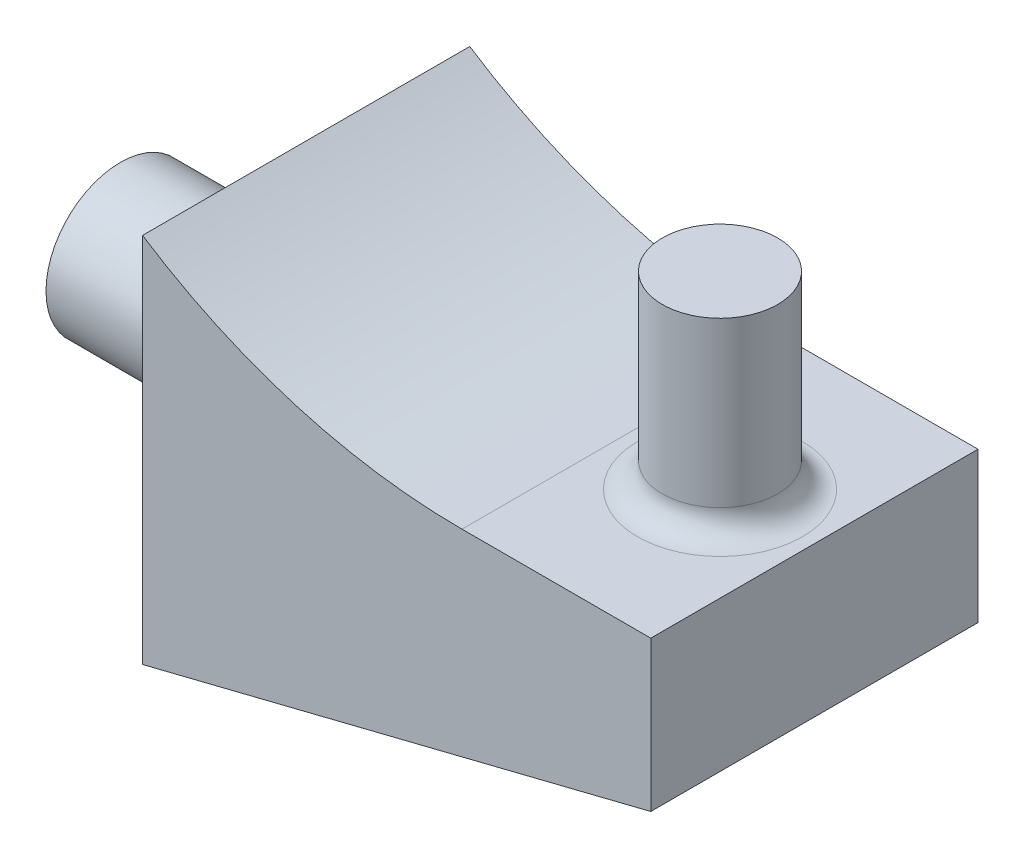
from build123d import *

# Parameters (mm, degrees)
BOSS_EXTRUDE1_DEPTH = 26.416
SKETCH5_R           = 4.656567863
BOSS_EXTRUDE2_DEPTH = 15.24
SKETCH6_R           = 6
BOSS_EXTRUDE3_DEPTH = 15
FILLET1_R           = 2
FILLET2_R           = 2


with BuildPart() as part:
    # Sketch4 → Boss-Extrude1 (new body)
    with BuildSketch(Plane.XY):
        with BuildLine():
            Line((253.405334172, 274.985392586), (253.405334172, 244.985392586))
            Line((253.405334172, 244.985392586), (294.436722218, 255.22168408))
            Line((294.436722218, 255.22168408), (294.436722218, 267.343480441))
            Line((294.436722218, 267.343480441), (279.196722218, 267.343480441))
            ThreePointArc((279.196722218, 267.343480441), (265.746866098, 269.294144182), (253.405334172, 274.985392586))
        make_face()
    extrude(amount=BOSS_EXTRUDE1_DEPTH)

    # Sketch5 → Boss-Extrude2 (add)
    with BuildSketch(Plane(origin=(0, 267.343480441, 0), x_dir=(1, 0, 0), z_dir=(0, 1, 0))):
        with Locations(Location((286.816722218, -13.208, 0), (0, 0, 90))):
            Circle(SKETCH5_R)
    extrude(amount=BOSS_EXTRUDE2_DEPTH)

    # Sketch6 → Boss-Extrude3 (add)
    with BuildSketch(Plane.ZY.offset(-253.405334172)):
        with Locations((13.208, 259.985392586)):
            Circle(SKETCH6_R)
    extrude(amount=BOSS_EXTRUDE3_DEPTH)

    # Fillet1
    fillet1_edges = [part.edges().sort_by_distance(p)[0] for p in [
        (253.405334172, 259.985392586, 7.208),
    ]]
    fillet(fillet1_edges, radius=FILLET1_R)

    # Fillet2
    fillet2_edges = [part.edges().sort_by_distance(p)[0] for p in [
        (286.816722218, 267.343480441, 17.864567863),
    ]]
    fillet(fillet2_edges, radius=FILLET2_R)


solid = part.part
